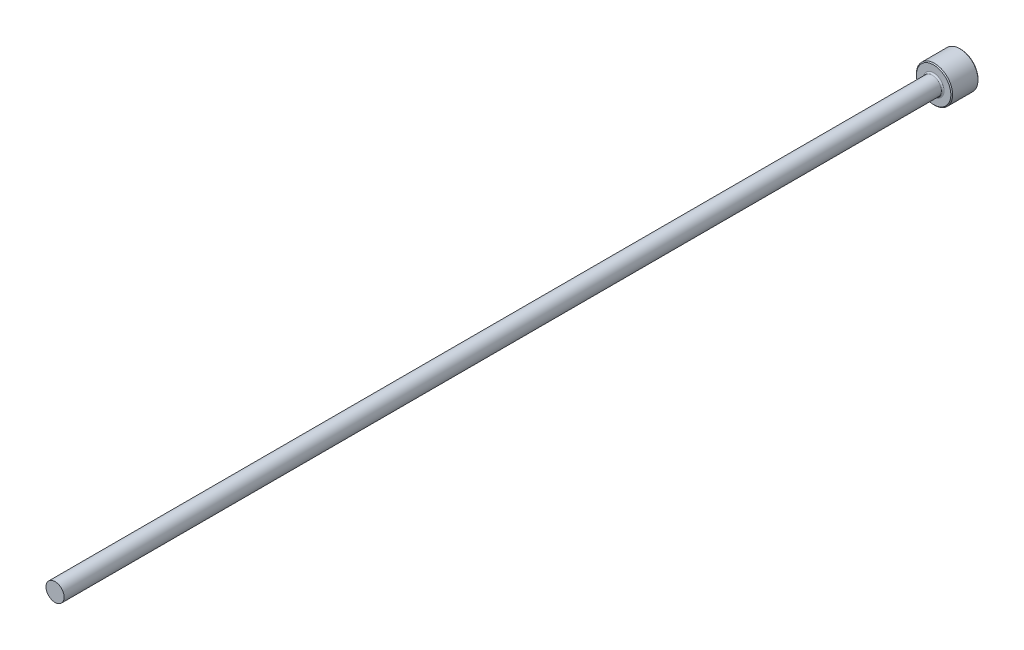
from build123d import *

# Parameters (mm, degrees)
CHAMFER1_SIZE = 0.2


with BuildPart() as part:
    # Sketch1 → Revolve1 (revolve)
    with BuildSketch(Plane(origin=(0, 0, 0), x_dir=(0, 0, -1), z_dir=(1, 0, 0)), mode=Mode.PRIVATE) as revolve1_sk:
        with BuildLine():
            Line((0, 0), (0, 4))
            Line((0, 4), (-6, 4))
            Line((-6, 4), (-6, 2.3))
            ThreePointArc((-6, 2.3), (-6.087867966, 2.087867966), (-6.3, 2))
            Line((-6.3, 2), (-200, 2))
            Line((-200, 2), (-200, 0))
            Line((-200, 0), (0, 0))
        make_face()
    revolve(revolve1_sk.sketch.rotate(Axis((0, 0, 109.05062828), (0, 0, -1)), 90), axis=Axis((0, 0, 109.05062828), (0, 0, -1)))

    # Chamfer1
    chamfer1_edges = [part.edges().sort_by_distance(p)[0] for p in [
        (-4, 0, 0),
        (-4, 0, 6),
    ]]
    chamfer(chamfer1_edges, length=CHAMFER1_SIZE)


solid = part.part
